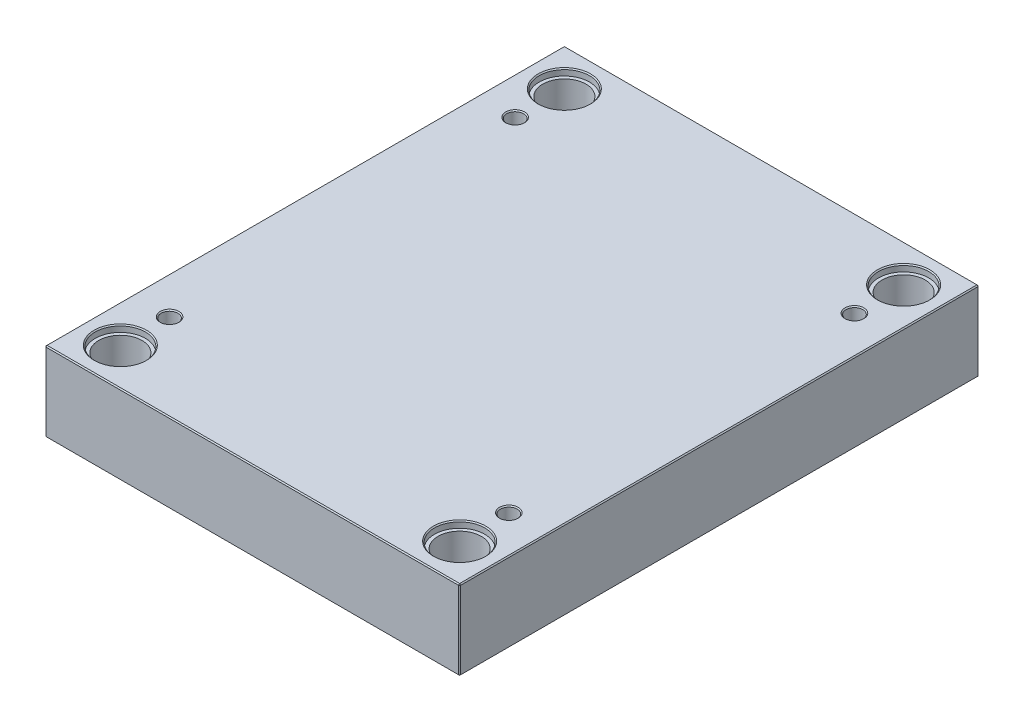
ISO-10303-21;
HEADER;
FILE_DESCRIPTION(('STEP AP214'),'2;1');
FILE_NAME('part.step','',(''),(''),'','','');
FILE_SCHEMA(('AUTOMOTIVE_DESIGN { 1 0 10303 214 1 1 1 1 }'));
ENDSEC;
DATA;
#1=APPLICATION_CONTEXT('core data for automotive mechanical design processes');
#2=APPLICATION_PROTOCOL_DEFINITION('international standard','automotive_design',2000,#1);
#3=PRODUCT_CONTEXT('',#1,'mechanical');
#4=PRODUCT('Part','Part','',(#3));
#5=PRODUCT_RELATED_PRODUCT_CATEGORY('part','',(#4));
#6=PRODUCT_DEFINITION_FORMATION('','',#4);
#7=PRODUCT_DEFINITION_CONTEXT('part definition',#1,'design');
#8=PRODUCT_DEFINITION('design','',#6,#7);
#9=PRODUCT_DEFINITION_SHAPE('','',#8);
#10=(LENGTH_UNIT() NAMED_UNIT(*) SI_UNIT(.MILLI.,.METRE.));
#11=(NAMED_UNIT(*) PLANE_ANGLE_UNIT() SI_UNIT($,.RADIAN.));
#12=(NAMED_UNIT(*) SI_UNIT($,.STERADIAN.) SOLID_ANGLE_UNIT());
#13=UNCERTAINTY_MEASURE_WITH_UNIT(LENGTH_MEASURE(1.E-05),#10,'distance_accuracy_value','');
#14=(GEOMETRIC_REPRESENTATION_CONTEXT(3) GLOBAL_UNCERTAINTY_ASSIGNED_CONTEXT((#13)) GLOBAL_UNIT_ASSIGNED_CONTEXT((#10,
#11,#12)) REPRESENTATION_CONTEXT('',''));
#15=CARTESIAN_POINT('',(0.,0.,0.));
#16=DIRECTION('',(0.,0.,1.));
#17=DIRECTION('',(1.,0.,0.));
#18=AXIS2_PLACEMENT_3D('',#15,#16,#17);
#19=CARTESIAN_POINT('',(-162.,0.,-212.));
#20=DIRECTION('',(0.,1.,0.));
#21=DIRECTION('',(0.,0.,1.));
#22=AXIS2_PLACEMENT_3D('',#19,#20,#21);
#23=CYLINDRICAL_SURFACE('',#22,20.65);
#24=CARTESIAN_POINT('',(-162.,0.999999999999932,-212.));
#25=DIRECTION('',(0.,1.,0.));
#26=DIRECTION('',(0.,0.,1.));
#27=AXIS2_PLACEMENT_3D('',#24,#25,#26);
#28=CIRCLE('',#27,20.65);
#29=CARTESIAN_POINT('',(-162.,0.999999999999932,-191.35));
#30=VERTEX_POINT('',#29);
#31=EDGE_CURVE('E472',#30,#30,#28,.F.);
#32=ORIENTED_EDGE('',*,*,#31,.T.);
#33=EDGE_LOOP('',(#32));
#34=FACE_BOUND('',#33,.T.);
#35=CARTESIAN_POINT('',(-162.,69.7,-212.));
#36=DIRECTION('',(0.,1.,0.));
#37=DIRECTION('',(0.,0.,1.));
#38=AXIS2_PLACEMENT_3D('',#35,#36,#37);
#39=CIRCLE('',#38,20.65);
#40=CARTESIAN_POINT('',(-162.,69.7,-191.35));
#41=VERTEX_POINT('',#40);
#42=EDGE_CURVE('E221',#41,#41,#39,.F.);
#43=ORIENTED_EDGE('',*,*,#42,.F.);
#44=EDGE_LOOP('',(#43));
#45=FACE_BOUND('',#44,.T.);
#46=ADVANCED_FACE('F16',(#34,#45),#23,.F.);
#47=CARTESIAN_POINT('',(162.,0.,-212.));
#48=DIRECTION('',(0.,1.,0.));
#49=DIRECTION('',(0.,0.,1.));
#50=AXIS2_PLACEMENT_3D('',#47,#48,#49);
#51=CYLINDRICAL_SURFACE('',#50,20.65);
#52=CARTESIAN_POINT('',(162.,0.999999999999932,-212.));
#53=DIRECTION('',(0.,1.,0.));
#54=DIRECTION('',(0.,0.,1.));
#55=AXIS2_PLACEMENT_3D('',#52,#53,#54);
#56=CIRCLE('',#55,20.65);
#57=CARTESIAN_POINT('',(162.,0.999999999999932,-191.35));
#58=VERTEX_POINT('',#57);
#59=EDGE_CURVE('E474',#58,#58,#56,.F.);
#60=ORIENTED_EDGE('',*,*,#59,.T.);
#61=EDGE_LOOP('',(#60));
#62=FACE_BOUND('',#61,.T.);
#63=CARTESIAN_POINT('',(162.,69.7,-212.));
#64=DIRECTION('',(0.,1.,0.));
#65=DIRECTION('',(0.,0.,1.));
#66=AXIS2_PLACEMENT_3D('',#63,#64,#65);
#67=CIRCLE('',#66,20.65);
#68=CARTESIAN_POINT('',(162.,69.7,-191.35));
#69=VERTEX_POINT('',#68);
#70=EDGE_CURVE('E218',#69,#69,#67,.F.);
#71=ORIENTED_EDGE('',*,*,#70,.F.);
#72=EDGE_LOOP('',(#71));
#73=FACE_BOUND('',#72,.T.);
#74=ADVANCED_FACE('F263',(#62,#73),#51,.F.);
#75=CARTESIAN_POINT('',(162.,0.,212.));
#76=DIRECTION('',(0.,1.,0.));
#77=DIRECTION('',(0.,0.,1.));
#78=AXIS2_PLACEMENT_3D('',#75,#76,#77);
#79=CYLINDRICAL_SURFACE('',#78,20.65);
#80=CARTESIAN_POINT('',(162.,1.00000000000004,212.));
#81=DIRECTION('',(0.,1.,0.));
#82=DIRECTION('',(0.,0.,1.));
#83=AXIS2_PLACEMENT_3D('',#80,#81,#82);
#84=CIRCLE('',#83,20.65);
#85=CARTESIAN_POINT('',(162.,1.00000000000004,232.65));
#86=VERTEX_POINT('',#85);
#87=EDGE_CURVE('E477',#86,#86,#84,.F.);
#88=ORIENTED_EDGE('',*,*,#87,.T.);
#89=EDGE_LOOP('',(#88));
#90=FACE_BOUND('',#89,.T.);
#91=CARTESIAN_POINT('',(162.,69.7,212.));
#92=DIRECTION('',(0.,1.,0.));
#93=DIRECTION('',(0.,0.,1.));
#94=AXIS2_PLACEMENT_3D('',#91,#92,#93);
#95=CIRCLE('',#94,20.65);
#96=CARTESIAN_POINT('',(162.,69.7,232.65));
#97=VERTEX_POINT('',#96);
#98=EDGE_CURVE('E214',#97,#97,#95,.F.);
#99=ORIENTED_EDGE('',*,*,#98,.F.);
#100=EDGE_LOOP('',(#99));
#101=FACE_BOUND('',#100,.T.);
#102=ADVANCED_FACE('F270',(#90,#101),#79,.F.);
#103=CARTESIAN_POINT('',(-162.,0.,212.));
#104=DIRECTION('',(0.,1.,0.));
#105=DIRECTION('',(0.,0.,1.));
#106=AXIS2_PLACEMENT_3D('',#103,#104,#105);
#107=CYLINDRICAL_SURFACE('',#106,20.65);
#108=CARTESIAN_POINT('',(-162.,0.999999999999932,212.));
#109=DIRECTION('',(0.,1.,0.));
#110=DIRECTION('',(0.,0.,1.));
#111=AXIS2_PLACEMENT_3D('',#108,#109,#110);
#112=CIRCLE('',#111,20.65);
#113=CARTESIAN_POINT('',(-162.,0.999999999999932,232.65));
#114=VERTEX_POINT('',#113);
#115=EDGE_CURVE('E480',#114,#114,#112,.F.);
#116=ORIENTED_EDGE('',*,*,#115,.T.);
#117=EDGE_LOOP('',(#116));
#118=FACE_BOUND('',#117,.T.);
#119=CARTESIAN_POINT('',(-162.,69.7,212.));
#120=DIRECTION('',(0.,1.,0.));
#121=DIRECTION('',(0.,0.,1.));
#122=AXIS2_PLACEMENT_3D('',#119,#120,#121);
#123=CIRCLE('',#122,20.65);
#124=CARTESIAN_POINT('',(-162.,69.7,232.65));
#125=VERTEX_POINT('',#124);
#126=EDGE_CURVE('E211',#125,#125,#123,.F.);
#127=ORIENTED_EDGE('',*,*,#126,.F.);
#128=EDGE_LOOP('',(#127));
#129=FACE_BOUND('',#128,.T.);
#130=ADVANCED_FACE('F277',(#118,#129),#107,.F.);
#131=CARTESIAN_POINT('',(-198.,76.,248.));
#132=DIRECTION('',(1.,0.,0.));
#133=DIRECTION('',(0.,0.,-1.));
#134=AXIS2_PLACEMENT_3D('',#131,#132,#133);
#135=PLANE('',#134);
#136=DIRECTION('',(0.,-1.,0.));
#137=VECTOR('',#136,1.);
#138=CARTESIAN_POINT('',(-198.,76.,-247.));
#139=LINE('',#138,#137);
#140=CARTESIAN_POINT('',(-198.,75.,-247.));
#141=VERTEX_POINT('',#140);
#142=CARTESIAN_POINT('',(-198.,1.00000000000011,-247.));
#143=VERTEX_POINT('',#142);
#144=EDGE_CURVE('E487',#141,#143,#139,.T.);
#145=ORIENTED_EDGE('',*,*,#144,.T.);
#146=DIRECTION('',(0.,0.,1.));
#147=VECTOR('',#146,1.);
#148=CARTESIAN_POINT('',(-198.,1.00000000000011,248.));
#149=LINE('',#148,#147);
#150=CARTESIAN_POINT('',(-198.,1.00000000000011,247.));
#151=VERTEX_POINT('',#150);
#152=EDGE_CURVE('E490',#143,#151,#149,.T.);
#153=ORIENTED_EDGE('',*,*,#152,.T.);
#154=DIRECTION('',(0.,1.,0.));
#155=VECTOR('',#154,1.);
#156=CARTESIAN_POINT('',(-198.,76.,247.));
#157=LINE('',#156,#155);
#158=CARTESIAN_POINT('',(-198.,75.,247.));
#159=VERTEX_POINT('',#158);
#160=EDGE_CURVE('E485',#151,#159,#157,.T.);
#161=ORIENTED_EDGE('',*,*,#160,.T.);
#162=DIRECTION('',(0.,0.,-1.));
#163=VECTOR('',#162,1.);
#164=CARTESIAN_POINT('',(-198.,75.,-248.));
#165=LINE('',#164,#163);
#166=EDGE_CURVE('E483',#159,#141,#165,.T.);
#167=ORIENTED_EDGE('',*,*,#166,.T.);
#168=EDGE_LOOP('',(#145,#153,#161,#167));
#169=FACE_BOUND('',#168,.T.);
#170=ADVANCED_FACE('F298',(#169),#135,.F.);
#171=CARTESIAN_POINT('',(198.,76.,248.));
#172=DIRECTION('',(0.,0.,-1.));
#173=DIRECTION('',(-1.,0.,0.));
#174=AXIS2_PLACEMENT_3D('',#171,#172,#173);
#175=PLANE('',#174);
#176=DIRECTION('',(-1.,0.,0.));
#177=VECTOR('',#176,1.);
#178=CARTESIAN_POINT('',(-198.,75.,248.));
#179=LINE('',#178,#177);
#180=CARTESIAN_POINT('',(197.,75.,248.));
#181=VERTEX_POINT('',#180);
#182=CARTESIAN_POINT('',(-197.,75.,248.));
#183=VERTEX_POINT('',#182);
#184=EDGE_CURVE('E509',#181,#183,#179,.T.);
#185=ORIENTED_EDGE('',*,*,#184,.T.);
#186=DIRECTION('',(0.,-1.,0.));
#187=VECTOR('',#186,1.);
#188=CARTESIAN_POINT('',(-197.,76.,248.));
#189=LINE('',#188,#187);
#190=CARTESIAN_POINT('',(-197.,1.00000000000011,248.));
#191=VERTEX_POINT('',#190);
#192=EDGE_CURVE('E515',#183,#191,#189,.T.);
#193=ORIENTED_EDGE('',*,*,#192,.T.);
#194=DIRECTION('',(1.,0.,0.));
#195=VECTOR('',#194,1.);
#196=CARTESIAN_POINT('',(198.,1.00000000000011,248.));
#197=LINE('',#196,#195);
#198=CARTESIAN_POINT('',(197.,1.00000000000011,248.));
#199=VERTEX_POINT('',#198);
#200=EDGE_CURVE('E513',#191,#199,#197,.T.);
#201=ORIENTED_EDGE('',*,*,#200,.T.);
#202=DIRECTION('',(0.,1.,0.));
#203=VECTOR('',#202,1.);
#204=CARTESIAN_POINT('',(197.,76.,248.));
#205=LINE('',#204,#203);
#206=EDGE_CURVE('E511',#199,#181,#205,.T.);
#207=ORIENTED_EDGE('',*,*,#206,.T.);
#208=EDGE_LOOP('',(#185,#193,#201,#207));
#209=FACE_BOUND('',#208,.T.);
#210=ADVANCED_FACE('F294',(#209),#175,.F.);
#211=CARTESIAN_POINT('',(198.,76.,248.));
#212=DIRECTION('',(-1.,0.,0.));
#213=DIRECTION('',(0.,0.,1.));
#214=AXIS2_PLACEMENT_3D('',#211,#212,#213);
#215=PLANE('',#214);
#216=DIRECTION('',(0.,0.,-1.));
#217=VECTOR('',#216,1.);
#218=CARTESIAN_POINT('',(198.,1.00000000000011,248.));
#219=LINE('',#218,#217);
#220=CARTESIAN_POINT('',(198.,1.00000000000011,247.));
#221=VERTEX_POINT('',#220);
#222=CARTESIAN_POINT('',(198.,1.00000000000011,-247.));
#223=VERTEX_POINT('',#222);
#224=EDGE_CURVE('E504',#221,#223,#219,.T.);
#225=ORIENTED_EDGE('',*,*,#224,.T.);
#226=DIRECTION('',(0.,1.,0.));
#227=VECTOR('',#226,1.);
#228=CARTESIAN_POINT('',(198.,76.,-247.));
#229=LINE('',#228,#227);
#230=CARTESIAN_POINT('',(198.,75.,-247.));
#231=VERTEX_POINT('',#230);
#232=EDGE_CURVE('E506',#223,#231,#229,.T.);
#233=ORIENTED_EDGE('',*,*,#232,.T.);
#234=DIRECTION('',(0.,0.,1.));
#235=VECTOR('',#234,1.);
#236=CARTESIAN_POINT('',(198.,75.,248.));
#237=LINE('',#236,#235);
#238=CARTESIAN_POINT('',(198.,75.,247.));
#239=VERTEX_POINT('',#238);
#240=EDGE_CURVE('E500',#231,#239,#237,.T.);
#241=ORIENTED_EDGE('',*,*,#240,.T.);
#242=DIRECTION('',(0.,-1.,0.));
#243=VECTOR('',#242,1.);
#244=CARTESIAN_POINT('',(198.,76.,247.));
#245=LINE('',#244,#243);
#246=EDGE_CURVE('E502',#239,#221,#245,.T.);
#247=ORIENTED_EDGE('',*,*,#246,.T.);
#248=EDGE_LOOP('',(#225,#233,#241,#247));
#249=FACE_BOUND('',#248,.T.);
#250=ADVANCED_FACE('F290',(#249),#215,.F.);
#251=CARTESIAN_POINT('',(198.,76.,-248.));
#252=DIRECTION('',(0.,0.,1.));
#253=DIRECTION('',(1.,0.,0.));
#254=AXIS2_PLACEMENT_3D('',#251,#252,#253);
#255=PLANE('',#254);
#256=DIRECTION('',(0.,-1.,0.));
#257=VECTOR('',#256,1.);
#258=CARTESIAN_POINT('',(197.,76.,-248.));
#259=LINE('',#258,#257);
#260=CARTESIAN_POINT('',(197.,75.,-248.));
#261=VERTEX_POINT('',#260);
#262=CARTESIAN_POINT('',(197.,1.00000000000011,-248.));
#263=VERTEX_POINT('',#262);
#264=EDGE_CURVE('E494',#261,#263,#259,.T.);
#265=ORIENTED_EDGE('',*,*,#264,.T.);
#266=DIRECTION('',(-1.,0.,0.));
#267=VECTOR('',#266,1.);
#268=CARTESIAN_POINT('',(198.,1.00000000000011,-248.));
#269=LINE('',#268,#267);
#270=CARTESIAN_POINT('',(-197.,1.00000000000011,-248.));
#271=VERTEX_POINT('',#270);
#272=EDGE_CURVE('E138',#263,#271,#269,.T.);
#273=ORIENTED_EDGE('',*,*,#272,.T.);
#274=DIRECTION('',(0.,1.,0.));
#275=VECTOR('',#274,1.);
#276=CARTESIAN_POINT('',(-197.,76.,-248.));
#277=LINE('',#276,#275);
#278=CARTESIAN_POINT('',(-197.,75.,-248.));
#279=VERTEX_POINT('',#278);
#280=EDGE_CURVE('E496',#271,#279,#277,.T.);
#281=ORIENTED_EDGE('',*,*,#280,.T.);
#282=DIRECTION('',(1.,0.,0.));
#283=VECTOR('',#282,1.);
#284=CARTESIAN_POINT('',(198.,75.,-248.));
#285=LINE('',#284,#283);
#286=EDGE_CURVE('E492',#279,#261,#285,.T.);
#287=ORIENTED_EDGE('',*,*,#286,.T.);
#288=EDGE_LOOP('',(#265,#273,#281,#287));
#289=FACE_BOUND('',#288,.T.);
#290=ADVANCED_FACE('F282',(#289),#255,.F.);
#291=CARTESIAN_POINT('',(0.,76.,0.));
#292=DIRECTION('',(0.,1.,0.));
#293=DIRECTION('',(0.,0.,1.));
#294=AXIS2_PLACEMENT_3D('',#291,#292,#293);
#295=PLANE('',#294);
#296=CARTESIAN_POINT('',(162.,76.,212.));
#297=DIRECTION('',(0.,1.,0.));
#298=DIRECTION('',(0.,0.,1.));
#299=AXIS2_PLACEMENT_3D('',#296,#297,#298);
#300=CIRCLE('',#299,25.);
#301=CARTESIAN_POINT('',(162.,76.,237.));
#302=VERTEX_POINT('',#301);
#303=EDGE_CURVE('E236',#302,#302,#300,.F.);
#304=ORIENTED_EDGE('',*,*,#303,.T.);
#305=EDGE_LOOP('',(#304));
#306=FACE_BOUND('',#305,.T.);
#307=CARTESIAN_POINT('',(-162.,76.,212.));
#308=DIRECTION('',(0.,1.,0.));
#309=DIRECTION('',(0.,0.,1.));
#310=AXIS2_PLACEMENT_3D('',#307,#308,#309);
#311=CIRCLE('',#310,25.);
#312=CARTESIAN_POINT('',(-162.,76.,237.));
#313=VERTEX_POINT('',#312);
#314=EDGE_CURVE('E233',#313,#313,#311,.F.);
#315=ORIENTED_EDGE('',*,*,#314,.T.);
#316=EDGE_LOOP('',(#315));
#317=FACE_BOUND('',#316,.T.);
#318=CARTESIAN_POINT('',(162.,76.,-212.));
#319=DIRECTION('',(0.,1.,0.));
#320=DIRECTION('',(0.,0.,1.));
#321=AXIS2_PLACEMENT_3D('',#318,#319,#320);
#322=CIRCLE('',#321,25.);
#323=CARTESIAN_POINT('',(162.,76.,-187.));
#324=VERTEX_POINT('',#323);
#325=EDGE_CURVE('E230',#324,#324,#322,.F.);
#326=ORIENTED_EDGE('',*,*,#325,.T.);
#327=EDGE_LOOP('',(#326));
#328=FACE_BOUND('',#327,.T.);
#329=CARTESIAN_POINT('',(-162.,76.,-212.));
#330=DIRECTION('',(0.,1.,0.));
#331=DIRECTION('',(0.,0.,1.));
#332=AXIS2_PLACEMENT_3D('',#329,#330,#331);
#333=CIRCLE('',#332,25.);
#334=CARTESIAN_POINT('',(-162.,76.,-187.));
#335=VERTEX_POINT('',#334);
#336=EDGE_CURVE('E227',#335,#335,#333,.F.);
#337=ORIENTED_EDGE('',*,*,#336,.T.);
#338=EDGE_LOOP('',(#337));
#339=FACE_BOUND('',#338,.T.);
#340=CARTESIAN_POINT('',(-162.,76.,165.));
#341=DIRECTION('',(0.,1.,0.));
#342=DIRECTION('',(0.,0.,1.));
#343=AXIS2_PLACEMENT_3D('',#340,#341,#342);
#344=CIRCLE('',#343,9.00000000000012);
#345=CARTESIAN_POINT('',(-162.,76.,174.));
#346=VERTEX_POINT('',#345);
#347=EDGE_CURVE('E198',#346,#346,#344,.F.);
#348=ORIENTED_EDGE('',*,*,#347,.T.);
#349=EDGE_LOOP('',(#348));
#350=FACE_BOUND('',#349,.T.);
#351=CARTESIAN_POINT('',(162.,76.,165.));
#352=DIRECTION('',(0.,1.,0.));
#353=DIRECTION('',(0.,0.,1.));
#354=AXIS2_PLACEMENT_3D('',#351,#352,#353);
#355=CIRCLE('',#354,9.);
#356=CARTESIAN_POINT('',(162.,76.,174.));
#357=VERTEX_POINT('',#356);
#358=EDGE_CURVE('E195',#357,#357,#355,.F.);
#359=ORIENTED_EDGE('',*,*,#358,.T.);
#360=EDGE_LOOP('',(#359));
#361=FACE_BOUND('',#360,.T.);
#362=CARTESIAN_POINT('',(162.,76.,-165.));
#363=DIRECTION('',(0.,1.,0.));
#364=DIRECTION('',(0.,0.,1.));
#365=AXIS2_PLACEMENT_3D('',#362,#363,#364);
#366=CIRCLE('',#365,9.00000000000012);
#367=CARTESIAN_POINT('',(162.,76.,-156.));
#368=VERTEX_POINT('',#367);
#369=EDGE_CURVE('E192',#368,#368,#366,.F.);
#370=ORIENTED_EDGE('',*,*,#369,.T.);
#371=EDGE_LOOP('',(#370));
#372=FACE_BOUND('',#371,.T.);
#373=CARTESIAN_POINT('',(-162.,76.,-165.));
#374=DIRECTION('',(0.,1.,0.));
#375=DIRECTION('',(0.,0.,1.));
#376=AXIS2_PLACEMENT_3D('',#373,#374,#375);
#377=CIRCLE('',#376,9.);
#378=CARTESIAN_POINT('',(-162.,76.,-156.));
#379=VERTEX_POINT('',#378);
#380=EDGE_CURVE('E188',#379,#379,#377,.F.);
#381=ORIENTED_EDGE('',*,*,#380,.T.);
#382=EDGE_LOOP('',(#381));
#383=FACE_BOUND('',#382,.T.);
#384=DIRECTION('',(0.,0.,-1.));
#385=VECTOR('',#384,1.);
#386=CARTESIAN_POINT('',(197.,76.,-248.));
#387=LINE('',#386,#385);
#388=CARTESIAN_POINT('',(197.,76.,247.));
#389=VERTEX_POINT('',#388);
#390=CARTESIAN_POINT('',(197.,76.,-247.));
#391=VERTEX_POINT('',#390);
#392=EDGE_CURVE('E31',#389,#391,#387,.T.);
#393=ORIENTED_EDGE('',*,*,#392,.T.);
#394=DIRECTION('',(-1.,0.,0.));
#395=VECTOR('',#394,1.);
#396=CARTESIAN_POINT('',(-198.,76.,-247.));
#397=LINE('',#396,#395);
#398=CARTESIAN_POINT('',(-197.,76.,-247.));
#399=VERTEX_POINT('',#398);
#400=EDGE_CURVE('E189',#391,#399,#397,.T.);
#401=ORIENTED_EDGE('',*,*,#400,.T.);
#402=DIRECTION('',(0.,0.,1.));
#403=VECTOR('',#402,1.);
#404=CARTESIAN_POINT('',(-197.,76.,248.));
#405=LINE('',#404,#403);
#406=CARTESIAN_POINT('',(-197.,76.,247.));
#407=VERTEX_POINT('',#406);
#408=EDGE_CURVE('E518',#399,#407,#405,.T.);
#409=ORIENTED_EDGE('',*,*,#408,.T.);
#410=DIRECTION('',(1.,0.,0.));
#411=VECTOR('',#410,1.);
#412=CARTESIAN_POINT('',(198.,76.,247.));
#413=LINE('',#412,#411);
#414=EDGE_CURVE('E36',#407,#389,#413,.T.);
#415=ORIENTED_EDGE('',*,*,#414,.T.);
#416=EDGE_LOOP('',(#393,#401,#409,#415));
#417=FACE_BOUND('',#416,.T.);
#418=ADVANCED_FACE('F279',(#306,#317,#328,#339,#350,#361,#372,#383,#417),#295,.T.);
#419=CARTESIAN_POINT('',(0.,0.,0.));
#420=DIRECTION('',(0.,1.,0.));
#421=DIRECTION('',(0.,0.,1.));
#422=AXIS2_PLACEMENT_3D('',#419,#420,#421);
#423=PLANE('',#422);
#424=CARTESIAN_POINT('',(-162.,0.,-212.));
#425=DIRECTION('',(0.,1.,0.));
#426=DIRECTION('',(0.,0.,1.));
#427=AXIS2_PLACEMENT_3D('',#424,#425,#426);
#428=CIRCLE('',#427,21.65);
#429=CARTESIAN_POINT('',(-162.,0.,-190.35));
#430=VERTEX_POINT('',#429);
#431=EDGE_CURVE('E469',#430,#430,#428,.T.);
#432=ORIENTED_EDGE('',*,*,#431,.T.);
#433=EDGE_LOOP('',(#432));
#434=FACE_BOUND('',#433,.T.);
#435=CARTESIAN_POINT('',(162.,0.,-212.));
#436=DIRECTION('',(0.,1.,0.));
#437=DIRECTION('',(0.,0.,1.));
#438=AXIS2_PLACEMENT_3D('',#435,#436,#437);
#439=CIRCLE('',#438,21.65);
#440=CARTESIAN_POINT('',(162.,0.,-190.35));
#441=VERTEX_POINT('',#440);
#442=EDGE_CURVE('E466',#441,#441,#439,.T.);
#443=ORIENTED_EDGE('',*,*,#442,.T.);
#444=EDGE_LOOP('',(#443));
#445=FACE_BOUND('',#444,.T.);
#446=CARTESIAN_POINT('',(162.,0.,212.));
#447=DIRECTION('',(0.,1.,0.));
#448=DIRECTION('',(0.,0.,1.));
#449=AXIS2_PLACEMENT_3D('',#446,#447,#448);
#450=CIRCLE('',#449,21.65);
#451=CARTESIAN_POINT('',(162.,0.,233.65));
#452=VERTEX_POINT('',#451);
#453=EDGE_CURVE('E463',#452,#452,#450,.T.);
#454=ORIENTED_EDGE('',*,*,#453,.T.);
#455=EDGE_LOOP('',(#454));
#456=FACE_BOUND('',#455,.T.);
#457=CARTESIAN_POINT('',(-162.,0.,212.));
#458=DIRECTION('',(0.,1.,0.));
#459=DIRECTION('',(0.,0.,1.));
#460=AXIS2_PLACEMENT_3D('',#457,#458,#459);
#461=CIRCLE('',#460,21.65);
#462=CARTESIAN_POINT('',(-162.,0.,233.65));
#463=VERTEX_POINT('',#462);
#464=EDGE_CURVE('E460',#463,#463,#461,.T.);
#465=ORIENTED_EDGE('',*,*,#464,.T.);
#466=EDGE_LOOP('',(#465));
#467=FACE_BOUND('',#466,.T.);
#468=DIRECTION('',(0.,0.,1.));
#469=VECTOR('',#468,1.);
#470=CARTESIAN_POINT('',(197.,0.,0.));
#471=LINE('',#470,#469);
#472=CARTESIAN_POINT('',(197.,0.,-247.));
#473=VERTEX_POINT('',#472);
#474=CARTESIAN_POINT('',(197.,0.,247.));
#475=VERTEX_POINT('',#474);
#476=EDGE_CURVE('E108',#473,#475,#471,.T.);
#477=ORIENTED_EDGE('',*,*,#476,.T.);
#478=DIRECTION('',(-1.,0.,0.));
#479=VECTOR('',#478,1.);
#480=CARTESIAN_POINT('',(0.,0.,247.));
#481=LINE('',#480,#479);
#482=CARTESIAN_POINT('',(-197.,0.,247.));
#483=VERTEX_POINT('',#482);
#484=EDGE_CURVE('E458',#475,#483,#481,.T.);
#485=ORIENTED_EDGE('',*,*,#484,.T.);
#486=DIRECTION('',(0.,0.,-1.));
#487=VECTOR('',#486,1.);
#488=CARTESIAN_POINT('',(-197.,0.,0.));
#489=LINE('',#488,#487);
#490=CARTESIAN_POINT('',(-197.,0.,-247.));
#491=VERTEX_POINT('',#490);
#492=EDGE_CURVE('E110',#483,#491,#489,.T.);
#493=ORIENTED_EDGE('',*,*,#492,.T.);
#494=DIRECTION('',(1.,0.,0.));
#495=VECTOR('',#494,1.);
#496=CARTESIAN_POINT('',(0.,0.,-247.));
#497=LINE('',#496,#495);
#498=EDGE_CURVE('E104',#491,#473,#497,.T.);
#499=ORIENTED_EDGE('',*,*,#498,.T.);
#500=EDGE_LOOP('',(#477,#485,#493,#499));
#501=FACE_BOUND('',#500,.T.);
#502=ADVANCED_FACE('F106',(#434,#445,#456,#467,#501),#423,.F.);
#503=CARTESIAN_POINT('',(-162.,0.,-212.));
#504=DIRECTION('',(0.,-1.,0.));
#505=DIRECTION('',(0.,0.,-1.));
#506=AXIS2_PLACEMENT_3D('',#503,#504,#505);
#507=CONICAL_SURFACE('',#506,21.65,0.785398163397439);
#508=ORIENTED_EDGE('',*,*,#31,.F.);
#509=EDGE_LOOP('',(#508));
#510=FACE_BOUND('',#509,.T.);
#511=ORIENTED_EDGE('',*,*,#431,.F.);
#512=EDGE_LOOP('',(#511));
#513=FACE_BOUND('',#512,.T.);
#514=ADVANCED_FACE('F286',(#510,#513),#507,.F.);
#515=CARTESIAN_POINT('',(162.,0.,-212.));
#516=DIRECTION('',(0.,-1.,0.));
#517=DIRECTION('',(0.,0.,-1.));
#518=AXIS2_PLACEMENT_3D('',#515,#516,#517);
#519=CONICAL_SURFACE('',#518,21.65,0.785398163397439);
#520=ORIENTED_EDGE('',*,*,#59,.F.);
#521=EDGE_LOOP('',(#520));
#522=FACE_BOUND('',#521,.T.);
#523=ORIENTED_EDGE('',*,*,#442,.F.);
#524=EDGE_LOOP('',(#523));
#525=FACE_BOUND('',#524,.T.);
#526=ADVANCED_FACE('F305',(#522,#525),#519,.F.);
#527=CARTESIAN_POINT('',(162.,0.,212.));
#528=DIRECTION('',(0.,-1.,0.));
#529=DIRECTION('',(0.,0.,-1.));
#530=AXIS2_PLACEMENT_3D('',#527,#528,#529);
#531=CONICAL_SURFACE('',#530,21.65,0.785398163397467);
#532=ORIENTED_EDGE('',*,*,#87,.F.);
#533=EDGE_LOOP('',(#532));
#534=FACE_BOUND('',#533,.T.);
#535=ORIENTED_EDGE('',*,*,#453,.F.);
#536=EDGE_LOOP('',(#535));
#537=FACE_BOUND('',#536,.T.);
#538=ADVANCED_FACE('F309',(#534,#537),#531,.F.);
#539=CARTESIAN_POINT('',(-162.,0.,212.));
#540=DIRECTION('',(0.,-1.,0.));
#541=DIRECTION('',(0.,0.,-1.));
#542=AXIS2_PLACEMENT_3D('',#539,#540,#541);
#543=CONICAL_SURFACE('',#542,21.65,0.785398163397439);
#544=ORIENTED_EDGE('',*,*,#115,.F.);
#545=EDGE_LOOP('',(#544));
#546=FACE_BOUND('',#545,.T.);
#547=ORIENTED_EDGE('',*,*,#464,.F.);
#548=EDGE_LOOP('',(#547));
#549=FACE_BOUND('',#548,.T.);
#550=ADVANCED_FACE('F313',(#546,#549),#543,.F.);
#551=CARTESIAN_POINT('',(198.,76.,247.));
#552=DIRECTION('',(-0.707106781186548,0.,-0.707106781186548));
#553=DIRECTION('',(0.,-1.,0.));
#554=AXIS2_PLACEMENT_3D('',#551,#552,#553);
#555=PLANE('',#554);
#556=DIRECTION('',(-0.707106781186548,0.,0.707106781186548));
#557=VECTOR('',#556,1.);
#558=CARTESIAN_POINT('',(197.,75.,248.));
#559=LINE('',#558,#557);
#560=EDGE_CURVE('E126',#181,#239,#559,.F.);
#561=ORIENTED_EDGE('',*,*,#560,.F.);
#562=ORIENTED_EDGE('',*,*,#206,.F.);
#563=DIRECTION('',(0.707106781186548,0.,-0.707106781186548));
#564=VECTOR('',#563,1.);
#565=CARTESIAN_POINT('',(197.,1.00000000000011,248.));
#566=LINE('',#565,#564);
#567=EDGE_CURVE('E180',#221,#199,#566,.F.);
#568=ORIENTED_EDGE('',*,*,#567,.F.);
#569=ORIENTED_EDGE('',*,*,#246,.F.);
#570=EDGE_LOOP('',(#561,#562,#568,#569));
#571=FACE_BOUND('',#570,.T.);
#572=ADVANCED_FACE('F317',(#571),#555,.F.);
#573=CARTESIAN_POINT('',(197.,75.,248.));
#574=DIRECTION('',(0.577350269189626,0.577350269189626,0.577350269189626));
#575=DIRECTION('',(0.707106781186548,0.,-0.707106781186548));
#576=AXIS2_PLACEMENT_3D('',#573,#574,#575);
#577=PLANE('',#576);
#578=DIRECTION('',(0.,-0.707106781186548,0.707106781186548));
#579=VECTOR('',#578,1.);
#580=CARTESIAN_POINT('',(197.,75.,248.));
#581=LINE('',#580,#579);
#582=EDGE_CURVE('E175',#181,#389,#581,.F.);
#583=ORIENTED_EDGE('',*,*,#582,.F.);
#584=ORIENTED_EDGE('',*,*,#560,.T.);
#585=DIRECTION('',(-0.707106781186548,0.707106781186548,0.));
#586=VECTOR('',#585,1.);
#587=CARTESIAN_POINT('',(197.5,75.5,247.));
#588=LINE('',#587,#586);
#589=EDGE_CURVE('E177',#389,#239,#588,.F.);
#590=ORIENTED_EDGE('',*,*,#589,.F.);
#591=EDGE_LOOP('',(#583,#584,#590));
#592=FACE_BOUND('',#591,.T.);
#593=ADVANCED_FACE('F385',(#592),#577,.T.);
#594=CARTESIAN_POINT('',(197.,1.00000000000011,248.));
#595=DIRECTION('',(0.577350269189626,-0.577350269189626,0.577350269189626));
#596=DIRECTION('',(0.707106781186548,0.,-0.707106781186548));
#597=AXIS2_PLACEMENT_3D('',#594,#595,#596);
#598=PLANE('',#597);
#599=DIRECTION('',(-0.707106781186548,-0.707106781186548,0.));
#600=VECTOR('',#599,1.);
#601=CARTESIAN_POINT('',(197.5,0.500000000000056,247.));
#602=LINE('',#601,#600);
#603=EDGE_CURVE('E124',#221,#475,#602,.T.);
#604=ORIENTED_EDGE('',*,*,#603,.F.);
#605=ORIENTED_EDGE('',*,*,#567,.T.);
#606=DIRECTION('',(0.,0.707106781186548,0.707106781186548));
#607=VECTOR('',#606,1.);
#608=CARTESIAN_POINT('',(197.,1.00000000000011,248.));
#609=LINE('',#608,#607);
#610=EDGE_CURVE('E172',#475,#199,#609,.T.);
#611=ORIENTED_EDGE('',*,*,#610,.F.);
#612=EDGE_LOOP('',(#604,#605,#611));
#613=FACE_BOUND('',#612,.T.);
#614=ADVANCED_FACE('F381',(#613),#598,.T.);
#615=CARTESIAN_POINT('',(197.,76.,0.));
#616=DIRECTION('',(0.707106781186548,0.707106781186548,0.));
#617=DIRECTION('',(0.,0.,1.));
#618=AXIS2_PLACEMENT_3D('',#615,#616,#617);
#619=PLANE('',#618);
#620=ORIENTED_EDGE('',*,*,#589,.T.);
#621=ORIENTED_EDGE('',*,*,#240,.F.);
#622=DIRECTION('',(0.707106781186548,-0.707106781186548,0.));
#623=VECTOR('',#622,1.);
#624=CARTESIAN_POINT('',(198.,75.,-247.));
#625=LINE('',#624,#623);
#626=EDGE_CURVE('E166',#391,#231,#625,.T.);
#627=ORIENTED_EDGE('',*,*,#626,.F.);
#628=ORIENTED_EDGE('',*,*,#392,.F.);
#629=EDGE_LOOP('',(#620,#621,#627,#628));
#630=FACE_BOUND('',#629,.T.);
#631=ADVANCED_FACE('F377',(#630),#619,.T.);
#632=CARTESIAN_POINT('',(0.,76.,247.));
#633=DIRECTION('',(0.,0.707106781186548,0.707106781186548));
#634=DIRECTION('',(-1.,0.,0.));
#635=AXIS2_PLACEMENT_3D('',#632,#633,#634);
#636=PLANE('',#635);
#637=ORIENTED_EDGE('',*,*,#582,.T.);
#638=ORIENTED_EDGE('',*,*,#414,.F.);
#639=DIRECTION('',(0.,0.707106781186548,-0.707106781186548));
#640=VECTOR('',#639,1.);
#641=CARTESIAN_POINT('',(-197.,75.5,247.5));
#642=LINE('',#641,#640);
#643=EDGE_CURVE('E163',#183,#407,#642,.T.);
#644=ORIENTED_EDGE('',*,*,#643,.F.);
#645=ORIENTED_EDGE('',*,*,#184,.F.);
#646=EDGE_LOOP('',(#637,#638,#644,#645));
#647=FACE_BOUND('',#646,.T.);
#648=ADVANCED_FACE('F373',(#647),#636,.T.);
#649=CARTESIAN_POINT('',(-197.,76.,248.));
#650=DIRECTION('',(0.707106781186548,0.,-0.707106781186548));
#651=DIRECTION('',(0.,-1.,0.));
#652=AXIS2_PLACEMENT_3D('',#649,#650,#651);
#653=PLANE('',#652);
#654=DIRECTION('',(0.707106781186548,0.,0.707106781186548));
#655=VECTOR('',#654,1.);
#656=CARTESIAN_POINT('',(-197.,1.00000000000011,248.));
#657=LINE('',#656,#655);
#658=EDGE_CURVE('E157',#191,#151,#657,.F.);
#659=ORIENTED_EDGE('',*,*,#658,.F.);
#660=ORIENTED_EDGE('',*,*,#192,.F.);
#661=DIRECTION('',(-0.707106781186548,0.,-0.707106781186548));
#662=VECTOR('',#661,1.);
#663=CARTESIAN_POINT('',(-198.,75.,247.));
#664=LINE('',#663,#662);
#665=EDGE_CURVE('E160',#159,#183,#664,.F.);
#666=ORIENTED_EDGE('',*,*,#665,.F.);
#667=ORIENTED_EDGE('',*,*,#160,.F.);
#668=EDGE_LOOP('',(#659,#660,#666,#667));
#669=FACE_BOUND('',#668,.T.);
#670=ADVANCED_FACE('F369',(#669),#653,.F.);
#671=CARTESIAN_POINT('',(198.,1.00000000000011,248.));
#672=DIRECTION('',(0.,0.707106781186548,-0.707106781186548));
#673=DIRECTION('',(1.,0.,0.));
#674=AXIS2_PLACEMENT_3D('',#671,#672,#673);
#675=PLANE('',#674);
#676=ORIENTED_EDGE('',*,*,#610,.T.);
#677=ORIENTED_EDGE('',*,*,#200,.F.);
#678=DIRECTION('',(0.,-0.707106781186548,-0.707106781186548));
#679=VECTOR('',#678,1.);
#680=CARTESIAN_POINT('',(-197.,1.00000000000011,248.));
#681=LINE('',#680,#679);
#682=EDGE_CURVE('E135',#483,#191,#681,.F.);
#683=ORIENTED_EDGE('',*,*,#682,.F.);
#684=ORIENTED_EDGE('',*,*,#484,.F.);
#685=EDGE_LOOP('',(#676,#677,#683,#684));
#686=FACE_BOUND('',#685,.T.);
#687=ADVANCED_FACE('F366',(#686),#675,.F.);
#688=CARTESIAN_POINT('',(198.,1.00000000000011,248.));
#689=DIRECTION('',(-0.707106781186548,0.707106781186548,0.));
#690=DIRECTION('',(0.,0.,-1.));
#691=AXIS2_PLACEMENT_3D('',#688,#689,#690);
#692=PLANE('',#691);
#693=ORIENTED_EDGE('',*,*,#603,.T.);
#694=ORIENTED_EDGE('',*,*,#476,.F.);
#695=DIRECTION('',(0.707106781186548,0.707106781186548,0.));
#696=VECTOR('',#695,1.);
#697=CARTESIAN_POINT('',(197.5,0.50000000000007,-247.));
#698=LINE('',#697,#696);
#699=EDGE_CURVE('E121',#223,#473,#698,.F.);
#700=ORIENTED_EDGE('',*,*,#699,.F.);
#701=ORIENTED_EDGE('',*,*,#224,.F.);
#702=EDGE_LOOP('',(#693,#694,#700,#701));
#703=FACE_BOUND('',#702,.T.);
#704=ADVANCED_FACE('F119',(#703),#692,.F.);
#705=CARTESIAN_POINT('',(197.,76.,-248.));
#706=DIRECTION('',(-0.707106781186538,0.,0.707106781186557));
#707=DIRECTION('',(0.,-1.,0.));
#708=AXIS2_PLACEMENT_3D('',#705,#706,#707);
#709=PLANE('',#708);
#710=DIRECTION('',(0.707106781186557,0.,0.707106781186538));
#711=VECTOR('',#710,1.);
#712=CARTESIAN_POINT('',(198.,75.,-247.));
#713=LINE('',#712,#711);
#714=EDGE_CURVE('E168',#231,#261,#713,.F.);
#715=ORIENTED_EDGE('',*,*,#714,.F.);
#716=ORIENTED_EDGE('',*,*,#232,.F.);
#717=DIRECTION('',(-0.707106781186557,0.,-0.707106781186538));
#718=VECTOR('',#717,1.);
#719=CARTESIAN_POINT('',(197.,1.00000000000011,-248.));
#720=LINE('',#719,#718);
#721=EDGE_CURVE('E134',#263,#223,#720,.F.);
#722=ORIENTED_EDGE('',*,*,#721,.F.);
#723=ORIENTED_EDGE('',*,*,#264,.F.);
#724=EDGE_LOOP('',(#715,#716,#722,#723));
#725=FACE_BOUND('',#724,.T.);
#726=ADVANCED_FACE('F359',(#725),#709,.F.);
#727=CARTESIAN_POINT('',(198.,75.,-247.));
#728=DIRECTION('',(0.577350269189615,0.577350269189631,-0.577350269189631));
#729=DIRECTION('',(0.,0.707106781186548,0.707106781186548));
#730=AXIS2_PLACEMENT_3D('',#727,#728,#729);
#731=PLANE('',#730);
#732=ORIENTED_EDGE('',*,*,#626,.T.);
#733=ORIENTED_EDGE('',*,*,#714,.T.);
#734=DIRECTION('',(0.,0.707106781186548,0.707106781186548));
#735=VECTOR('',#734,1.);
#736=CARTESIAN_POINT('',(197.,75.5,-247.5));
#737=LINE('',#736,#735);
#738=EDGE_CURVE('E152',#391,#261,#737,.F.);
#739=ORIENTED_EDGE('',*,*,#738,.F.);
#740=EDGE_LOOP('',(#732,#733,#739));
#741=FACE_BOUND('',#740,.T.);
#742=ADVANCED_FACE('F355',(#741),#731,.T.);
#743=CARTESIAN_POINT('',(-198.,75.,247.));
#744=DIRECTION('',(-0.577350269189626,0.577350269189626,0.577350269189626));
#745=DIRECTION('',(0.707106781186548,0.,0.707106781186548));
#746=AXIS2_PLACEMENT_3D('',#743,#744,#745);
#747=PLANE('',#746);
#748=ORIENTED_EDGE('',*,*,#665,.T.);
#749=ORIENTED_EDGE('',*,*,#643,.T.);
#750=DIRECTION('',(-0.707106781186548,-0.707106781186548,0.));
#751=VECTOR('',#750,1.);
#752=CARTESIAN_POINT('',(-198.,75.,247.));
#753=LINE('',#752,#751);
#754=EDGE_CURVE('E143',#159,#407,#753,.F.);
#755=ORIENTED_EDGE('',*,*,#754,.F.);
#756=EDGE_LOOP('',(#748,#749,#755));
#757=FACE_BOUND('',#756,.T.);
#758=ADVANCED_FACE('F351',(#757),#747,.T.);
#759=CARTESIAN_POINT('',(-197.,1.00000000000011,248.));
#760=DIRECTION('',(-0.577350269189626,-0.577350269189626,0.577350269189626));
#761=DIRECTION('',(0.707106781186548,0.,0.707106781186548));
#762=AXIS2_PLACEMENT_3D('',#759,#760,#761);
#763=PLANE('',#762);
#764=ORIENTED_EDGE('',*,*,#682,.T.);
#765=ORIENTED_EDGE('',*,*,#658,.T.);
#766=DIRECTION('',(-0.707106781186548,0.707106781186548,0.));
#767=VECTOR('',#766,1.);
#768=CARTESIAN_POINT('',(-197.5,0.500000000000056,247.));
#769=LINE('',#768,#767);
#770=EDGE_CURVE('E139',#483,#151,#769,.T.);
#771=ORIENTED_EDGE('',*,*,#770,.F.);
#772=EDGE_LOOP('',(#764,#765,#771));
#773=FACE_BOUND('',#772,.T.);
#774=ADVANCED_FACE('F348',(#773),#763,.T.);
#775=CARTESIAN_POINT('',(197.,1.00000000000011,-248.));
#776=DIRECTION('',(0.577350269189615,-0.577350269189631,-0.577350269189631));
#777=DIRECTION('',(0.,0.707106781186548,-0.707106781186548));
#778=AXIS2_PLACEMENT_3D('',#775,#776,#777);
#779=PLANE('',#778);
#780=ORIENTED_EDGE('',*,*,#721,.T.);
#781=ORIENTED_EDGE('',*,*,#699,.T.);
#782=DIRECTION('',(0.,-0.707106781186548,0.707106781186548));
#783=VECTOR('',#782,1.);
#784=CARTESIAN_POINT('',(197.,1.00000000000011,-248.));
#785=LINE('',#784,#783);
#786=EDGE_CURVE('E131',#263,#473,#785,.T.);
#787=ORIENTED_EDGE('',*,*,#786,.F.);
#788=EDGE_LOOP('',(#780,#781,#787));
#789=FACE_BOUND('',#788,.T.);
#790=ADVANCED_FACE('F130',(#789),#779,.T.);
#791=CARTESIAN_POINT('',(0.,76.,-247.));
#792=DIRECTION('',(0.,0.707106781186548,-0.707106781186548));
#793=DIRECTION('',(1.,0.,0.));
#794=AXIS2_PLACEMENT_3D('',#791,#792,#793);
#795=PLANE('',#794);
#796=ORIENTED_EDGE('',*,*,#738,.T.);
#797=ORIENTED_EDGE('',*,*,#286,.F.);
#798=DIRECTION('',(0.,-0.707106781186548,-0.707106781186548));
#799=VECTOR('',#798,1.);
#800=CARTESIAN_POINT('',(-197.,75.,-248.));
#801=LINE('',#800,#799);
#802=EDGE_CURVE('E140',#399,#279,#801,.T.);
#803=ORIENTED_EDGE('',*,*,#802,.F.);
#804=ORIENTED_EDGE('',*,*,#400,.F.);
#805=EDGE_LOOP('',(#796,#797,#803,#804));
#806=FACE_BOUND('',#805,.T.);
#807=ADVANCED_FACE('F341',(#806),#795,.T.);
#808=CARTESIAN_POINT('',(-197.,76.,0.));
#809=DIRECTION('',(-0.707106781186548,0.707106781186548,0.));
#810=DIRECTION('',(0.,0.,-1.));
#811=AXIS2_PLACEMENT_3D('',#808,#809,#810);
#812=PLANE('',#811);
#813=ORIENTED_EDGE('',*,*,#754,.T.);
#814=ORIENTED_EDGE('',*,*,#408,.F.);
#815=DIRECTION('',(0.707106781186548,0.707106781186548,0.));
#816=VECTOR('',#815,1.);
#817=CARTESIAN_POINT('',(-197.5,75.5,-247.));
#818=LINE('',#817,#816);
#819=EDGE_CURVE('E146',#141,#399,#818,.T.);
#820=ORIENTED_EDGE('',*,*,#819,.F.);
#821=ORIENTED_EDGE('',*,*,#166,.F.);
#822=EDGE_LOOP('',(#813,#814,#820,#821));
#823=FACE_BOUND('',#822,.T.);
#824=ADVANCED_FACE('F337',(#823),#812,.T.);
#825=CARTESIAN_POINT('',(-198.,1.00000000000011,248.));
#826=DIRECTION('',(0.707106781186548,0.707106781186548,0.));
#827=DIRECTION('',(0.,0.,1.));
#828=AXIS2_PLACEMENT_3D('',#825,#826,#827);
#829=PLANE('',#828);
#830=ORIENTED_EDGE('',*,*,#770,.T.);
#831=ORIENTED_EDGE('',*,*,#152,.F.);
#832=DIRECTION('',(0.707106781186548,-0.707106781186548,0.));
#833=VECTOR('',#832,1.);
#834=CARTESIAN_POINT('',(-198.,1.00000000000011,-247.));
#835=LINE('',#834,#833);
#836=EDGE_CURVE('E529',#491,#143,#835,.F.);
#837=ORIENTED_EDGE('',*,*,#836,.F.);
#838=ORIENTED_EDGE('',*,*,#492,.F.);
#839=EDGE_LOOP('',(#830,#831,#837,#838));
#840=FACE_BOUND('',#839,.T.);
#841=ADVANCED_FACE('F334',(#840),#829,.F.);
#842=CARTESIAN_POINT('',(198.,1.00000000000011,-248.));
#843=DIRECTION('',(0.,0.707106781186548,0.707106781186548));
#844=DIRECTION('',(-1.,0.,0.));
#845=AXIS2_PLACEMENT_3D('',#842,#843,#844);
#846=PLANE('',#845);
#847=ORIENTED_EDGE('',*,*,#786,.T.);
#848=ORIENTED_EDGE('',*,*,#498,.F.);
#849=DIRECTION('',(0.,0.707106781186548,-0.707106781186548));
#850=VECTOR('',#849,1.);
#851=CARTESIAN_POINT('',(-197.,0.500000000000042,-247.5));
#852=LINE('',#851,#850);
#853=EDGE_CURVE('E526',#271,#491,#852,.F.);
#854=ORIENTED_EDGE('',*,*,#853,.F.);
#855=ORIENTED_EDGE('',*,*,#272,.F.);
#856=EDGE_LOOP('',(#847,#848,#854,#855));
#857=FACE_BOUND('',#856,.T.);
#858=ADVANCED_FACE('F137',(#857),#846,.F.);
#859=CARTESIAN_POINT('',(-197.,75.,-248.));
#860=DIRECTION('',(-0.577350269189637,0.577350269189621,-0.577350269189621));
#861=DIRECTION('',(-0.707106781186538,0.,0.707106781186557));
#862=AXIS2_PLACEMENT_3D('',#859,#860,#861);
#863=PLANE('',#862);
#864=ORIENTED_EDGE('',*,*,#819,.T.);
#865=ORIENTED_EDGE('',*,*,#802,.T.);
#866=DIRECTION('',(0.707106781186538,0.,-0.707106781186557));
#867=VECTOR('',#866,1.);
#868=CARTESIAN_POINT('',(-197.,75.,-248.));
#869=LINE('',#868,#867);
#870=EDGE_CURVE('E524',#141,#279,#869,.T.);
#871=ORIENTED_EDGE('',*,*,#870,.F.);
#872=EDGE_LOOP('',(#864,#865,#871));
#873=FACE_BOUND('',#872,.T.);
#874=ADVANCED_FACE('F327',(#873),#863,.T.);
#875=CARTESIAN_POINT('',(-198.,1.00000000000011,-247.));
#876=DIRECTION('',(-0.577350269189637,-0.577350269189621,-0.577350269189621));
#877=DIRECTION('',(-0.707106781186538,0.,0.707106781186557));
#878=AXIS2_PLACEMENT_3D('',#875,#876,#877);
#879=PLANE('',#878);
#880=ORIENTED_EDGE('',*,*,#853,.T.);
#881=ORIENTED_EDGE('',*,*,#836,.T.);
#882=DIRECTION('',(-0.707106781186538,0.,0.707106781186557));
#883=VECTOR('',#882,1.);
#884=CARTESIAN_POINT('',(-198.,1.00000000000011,-247.));
#885=LINE('',#884,#883);
#886=EDGE_CURVE('E455',#271,#143,#885,.T.);
#887=ORIENTED_EDGE('',*,*,#886,.F.);
#888=EDGE_LOOP('',(#880,#881,#887));
#889=FACE_BOUND('',#888,.T.);
#890=ADVANCED_FACE('F323',(#889),#879,.T.);
#891=CARTESIAN_POINT('',(-198.,76.,-247.));
#892=DIRECTION('',(0.707106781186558,0.,0.707106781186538));
#893=DIRECTION('',(0.,-1.,0.));
#894=AXIS2_PLACEMENT_3D('',#891,#892,#893);
#895=PLANE('',#894);
#896=ORIENTED_EDGE('',*,*,#870,.T.);
#897=ORIENTED_EDGE('',*,*,#280,.F.);
#898=ORIENTED_EDGE('',*,*,#886,.T.);
#899=ORIENTED_EDGE('',*,*,#144,.F.);
#900=EDGE_LOOP('',(#896,#897,#898,#899));
#901=FACE_BOUND('',#900,.T.);
#902=ADVANCED_FACE('F319',(#901),#895,.F.);
#903=CARTESIAN_POINT('',(-162.,51.,-165.));
#904=DIRECTION('',(0.,1.,0.));
#905=DIRECTION('',(0.,0.,1.));
#906=AXIS2_PLACEMENT_3D('',#903,#904,#905);
#907=CYLINDRICAL_SURFACE('',#906,8.);
#908=CARTESIAN_POINT('',(-162.,75.,-165.));
#909=DIRECTION('',(0.,1.,0.));
#910=DIRECTION('',(0.,0.,1.));
#911=AXIS2_PLACEMENT_3D('',#908,#909,#910);
#912=CIRCLE('',#911,8.);
#913=CARTESIAN_POINT('',(-162.,75.,-157.));
#914=VERTEX_POINT('',#913);
#915=EDGE_CURVE('E207',#914,#914,#912,.T.);
#916=ORIENTED_EDGE('',*,*,#915,.T.);
#917=EDGE_LOOP('',(#916));
#918=FACE_BOUND('',#917,.T.);
#919=CARTESIAN_POINT('',(-162.,51.,-165.));
#920=DIRECTION('',(0.,1.,0.));
#921=DIRECTION('',(0.,0.,1.));
#922=AXIS2_PLACEMENT_3D('',#919,#920,#921);
#923=CIRCLE('',#922,8.);
#924=CARTESIAN_POINT('',(-162.,51.,-157.));
#925=VERTEX_POINT('',#924);
#926=EDGE_CURVE('E448',#925,#925,#923,.T.);
#927=ORIENTED_EDGE('',*,*,#926,.F.);
#928=EDGE_LOOP('',(#927));
#929=FACE_BOUND('',#928,.T.);
#930=ADVANCED_FACE('F322',(#918,#929),#907,.F.);
#931=CARTESIAN_POINT('',(-162.,51.,-165.));
#932=DIRECTION('',(0.,1.,0.));
#933=DIRECTION('',(0.,0.,1.));
#934=AXIS2_PLACEMENT_3D('',#931,#932,#933);
#935=PLANE('',#934);
#936=ORIENTED_EDGE('',*,*,#926,.T.);
#937=EDGE_LOOP('',(#936));
#938=FACE_BOUND('',#937,.T.);
#939=ADVANCED_FACE('F596',(#938),#935,.T.);
#940=CARTESIAN_POINT('',(162.,51.,-165.));
#941=DIRECTION('',(0.,1.,0.));
#942=DIRECTION('',(0.,0.,1.));
#943=AXIS2_PLACEMENT_3D('',#940,#941,#942);
#944=CYLINDRICAL_SURFACE('',#943,8.);
#945=CARTESIAN_POINT('',(162.,75.,-165.));
#946=DIRECTION('',(0.,1.,0.));
#947=DIRECTION('',(0.,0.,1.));
#948=AXIS2_PLACEMENT_3D('',#945,#946,#947);
#949=CIRCLE('',#948,8.);
#950=CARTESIAN_POINT('',(162.,75.,-157.));
#951=VERTEX_POINT('',#950);
#952=EDGE_CURVE('E204',#951,#951,#949,.T.);
#953=ORIENTED_EDGE('',*,*,#952,.T.);
#954=EDGE_LOOP('',(#953));
#955=FACE_BOUND('',#954,.T.);
#956=CARTESIAN_POINT('',(162.,51.,-165.));
#957=DIRECTION('',(0.,1.,0.));
#958=DIRECTION('',(0.,0.,1.));
#959=AXIS2_PLACEMENT_3D('',#956,#957,#958);
#960=CIRCLE('',#959,8.);
#961=CARTESIAN_POINT('',(162.,51.,-157.));
#962=VERTEX_POINT('',#961);
#963=EDGE_CURVE('E445',#962,#962,#960,.T.);
#964=ORIENTED_EDGE('',*,*,#963,.F.);
#965=EDGE_LOOP('',(#964));
#966=FACE_BOUND('',#965,.T.);
#967=ADVANCED_FACE('F592',(#955,#966),#944,.F.);
#968=CARTESIAN_POINT('',(162.,51.,-165.));
#969=DIRECTION('',(0.,1.,0.));
#970=DIRECTION('',(0.,0.,1.));
#971=AXIS2_PLACEMENT_3D('',#968,#969,#970);
#972=PLANE('',#971);
#973=ORIENTED_EDGE('',*,*,#963,.T.);
#974=EDGE_LOOP('',(#973));
#975=FACE_BOUND('',#974,.T.);
#976=ADVANCED_FACE('F588',(#975),#972,.T.);
#977=CARTESIAN_POINT('',(162.,51.,165.));
#978=DIRECTION('',(0.,1.,0.));
#979=DIRECTION('',(0.,0.,1.));
#980=AXIS2_PLACEMENT_3D('',#977,#978,#979);
#981=CYLINDRICAL_SURFACE('',#980,8.);
#982=CARTESIAN_POINT('',(162.,75.,165.));
#983=DIRECTION('',(0.,1.,0.));
#984=DIRECTION('',(0.,0.,1.));
#985=AXIS2_PLACEMENT_3D('',#982,#983,#984);
#986=CIRCLE('',#985,8.);
#987=CARTESIAN_POINT('',(162.,75.,173.));
#988=VERTEX_POINT('',#987);
#989=EDGE_CURVE('E201',#988,#988,#986,.T.);
#990=ORIENTED_EDGE('',*,*,#989,.T.);
#991=EDGE_LOOP('',(#990));
#992=FACE_BOUND('',#991,.T.);
#993=CARTESIAN_POINT('',(162.,51.,165.));
#994=DIRECTION('',(0.,1.,0.));
#995=DIRECTION('',(0.,0.,1.));
#996=AXIS2_PLACEMENT_3D('',#993,#994,#995);
#997=CIRCLE('',#996,8.);
#998=CARTESIAN_POINT('',(162.,51.,173.));
#999=VERTEX_POINT('',#998);
#1000=EDGE_CURVE('E449',#999,#999,#997,.T.);
#1001=ORIENTED_EDGE('',*,*,#1000,.F.);
#1002=EDGE_LOOP('',(#1001));
#1003=FACE_BOUND('',#1002,.T.);
#1004=ADVANCED_FACE('F591',(#992,#1003),#981,.F.);
#1005=CARTESIAN_POINT('',(162.,51.,165.));
#1006=DIRECTION('',(0.,1.,0.));
#1007=DIRECTION('',(0.,0.,1.));
#1008=AXIS2_PLACEMENT_3D('',#1005,#1006,#1007);
#1009=PLANE('',#1008);
#1010=ORIENTED_EDGE('',*,*,#1000,.T.);
#1011=EDGE_LOOP('',(#1010));
#1012=FACE_BOUND('',#1011,.T.);
#1013=ADVANCED_FACE('F598',(#1012),#1009,.T.);
#1014=CARTESIAN_POINT('',(-162.,51.,165.));
#1015=DIRECTION('',(0.,1.,0.));
#1016=DIRECTION('',(0.,0.,1.));
#1017=AXIS2_PLACEMENT_3D('',#1014,#1015,#1016);
#1018=CYLINDRICAL_SURFACE('',#1017,8.);
#1019=CARTESIAN_POINT('',(-162.,75.,165.));
#1020=DIRECTION('',(0.,1.,0.));
#1021=DIRECTION('',(0.,0.,1.));
#1022=AXIS2_PLACEMENT_3D('',#1019,#1020,#1021);
#1023=CIRCLE('',#1022,8.);
#1024=CARTESIAN_POINT('',(-162.,75.,173.));
#1025=VERTEX_POINT('',#1024);
#1026=EDGE_CURVE('E185',#1025,#1025,#1023,.T.);
#1027=ORIENTED_EDGE('',*,*,#1026,.T.);
#1028=EDGE_LOOP('',(#1027));
#1029=FACE_BOUND('',#1028,.T.);
#1030=CARTESIAN_POINT('',(-162.,51.,165.));
#1031=DIRECTION('',(0.,1.,0.));
#1032=DIRECTION('',(0.,0.,1.));
#1033=AXIS2_PLACEMENT_3D('',#1030,#1031,#1032);
#1034=CIRCLE('',#1033,8.);
#1035=CARTESIAN_POINT('',(-162.,51.,173.));
#1036=VERTEX_POINT('',#1035);
#1037=EDGE_CURVE('E224',#1036,#1036,#1034,.T.);
#1038=ORIENTED_EDGE('',*,*,#1037,.F.);
#1039=EDGE_LOOP('',(#1038));
#1040=FACE_BOUND('',#1039,.T.);
#1041=ADVANCED_FACE('F601',(#1029,#1040),#1018,.F.);
#1042=CARTESIAN_POINT('',(-162.,51.,165.));
#1043=DIRECTION('',(0.,1.,0.));
#1044=DIRECTION('',(0.,0.,1.));
#1045=AXIS2_PLACEMENT_3D('',#1042,#1043,#1044);
#1046=PLANE('',#1045);
#1047=ORIENTED_EDGE('',*,*,#1037,.T.);
#1048=EDGE_LOOP('',(#1047));
#1049=FACE_BOUND('',#1048,.T.);
#1050=ADVANCED_FACE('F397',(#1049),#1046,.T.);
#1051=CARTESIAN_POINT('',(-162.,75.,165.));
#1052=DIRECTION('',(0.,1.,0.));
#1053=DIRECTION('',(0.,0.,1.));
#1054=AXIS2_PLACEMENT_3D('',#1051,#1052,#1053);
#1055=CONICAL_SURFACE('',#1054,8.,0.785398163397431);
#1056=ORIENTED_EDGE('',*,*,#347,.F.);
#1057=EDGE_LOOP('',(#1056));
#1058=FACE_BOUND('',#1057,.T.);
#1059=ORIENTED_EDGE('',*,*,#1026,.F.);
#1060=EDGE_LOOP('',(#1059));
#1061=FACE_BOUND('',#1060,.T.);
#1062=ADVANCED_FACE('F393',(#1058,#1061),#1055,.F.);
#1063=CARTESIAN_POINT('',(162.,75.,165.));
#1064=DIRECTION('',(0.,1.,0.));
#1065=DIRECTION('',(0.,0.,1.));
#1066=AXIS2_PLACEMENT_3D('',#1063,#1064,#1065);
#1067=CONICAL_SURFACE('',#1066,8.,0.785398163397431);
#1068=ORIENTED_EDGE('',*,*,#358,.F.);
#1069=EDGE_LOOP('',(#1068));
#1070=FACE_BOUND('',#1069,.T.);
#1071=ORIENTED_EDGE('',*,*,#989,.F.);
#1072=EDGE_LOOP('',(#1071));
#1073=FACE_BOUND('',#1072,.T.);
#1074=ADVANCED_FACE('F396',(#1070,#1073),#1067,.F.);
#1075=CARTESIAN_POINT('',(162.,75.,-165.));
#1076=DIRECTION('',(0.,1.,0.));
#1077=DIRECTION('',(0.,0.,1.));
#1078=AXIS2_PLACEMENT_3D('',#1075,#1076,#1077);
#1079=CONICAL_SURFACE('',#1078,8.,0.785398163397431);
#1080=ORIENTED_EDGE('',*,*,#369,.F.);
#1081=EDGE_LOOP('',(#1080));
#1082=FACE_BOUND('',#1081,.T.);
#1083=ORIENTED_EDGE('',*,*,#952,.F.);
#1084=EDGE_LOOP('',(#1083));
#1085=FACE_BOUND('',#1084,.T.);
#1086=ADVANCED_FACE('F401',(#1082,#1085),#1079,.F.);
#1087=CARTESIAN_POINT('',(-162.,75.,-165.));
#1088=DIRECTION('',(0.,1.,0.));
#1089=DIRECTION('',(0.,0.,1.));
#1090=AXIS2_PLACEMENT_3D('',#1087,#1088,#1089);
#1091=CONICAL_SURFACE('',#1090,8.,0.785398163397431);
#1092=ORIENTED_EDGE('',*,*,#380,.F.);
#1093=EDGE_LOOP('',(#1092));
#1094=FACE_BOUND('',#1093,.T.);
#1095=ORIENTED_EDGE('',*,*,#915,.F.);
#1096=EDGE_LOOP('',(#1095));
#1097=FACE_BOUND('',#1096,.T.);
#1098=ADVANCED_FACE('F405',(#1094,#1097),#1091,.F.);
#1099=CARTESIAN_POINT('',(-162.,69.7,212.));
#1100=DIRECTION('',(0.,1.,0.));
#1101=DIRECTION('',(0.,0.,1.));
#1102=AXIS2_PLACEMENT_3D('',#1099,#1100,#1101);
#1103=PLANE('',#1102);
#1104=CARTESIAN_POINT('',(-162.,69.7,212.));
#1105=DIRECTION('',(0.,1.,0.));
#1106=DIRECTION('',(0.,0.,1.));
#1107=AXIS2_PLACEMENT_3D('',#1104,#1105,#1106);
#1108=CIRCLE('',#1107,24.);
#1109=CARTESIAN_POINT('',(-162.,69.7,236.));
#1110=VERTEX_POINT('',#1109);
#1111=EDGE_CURVE('E436',#1110,#1110,#1108,.T.);
#1112=ORIENTED_EDGE('',*,*,#1111,.T.);
#1113=EDGE_LOOP('',(#1112));
#1114=FACE_BOUND('',#1113,.T.);
#1115=ORIENTED_EDGE('',*,*,#126,.T.);
#1116=EDGE_LOOP('',(#1115));
#1117=FACE_BOUND('',#1116,.T.);
#1118=ADVANCED_FACE('F409',(#1114,#1117),#1103,.T.);
#1119=CARTESIAN_POINT('',(-162.,69.7,212.));
#1120=DIRECTION('',(0.,1.,0.));
#1121=DIRECTION('',(0.,0.,1.));
#1122=AXIS2_PLACEMENT_3D('',#1119,#1120,#1121);
#1123=CYLINDRICAL_SURFACE('',#1122,24.);
#1124=CARTESIAN_POINT('',(-162.,75.,212.));
#1125=DIRECTION('',(0.,1.,0.));
#1126=DIRECTION('',(0.,0.,1.));
#1127=AXIS2_PLACEMENT_3D('',#1124,#1125,#1126);
#1128=CIRCLE('',#1127,24.);
#1129=CARTESIAN_POINT('',(-162.,75.,236.));
#1130=VERTEX_POINT('',#1129);
#1131=EDGE_CURVE('E239',#1130,#1130,#1128,.T.);
#1132=ORIENTED_EDGE('',*,*,#1131,.T.);
#1133=EDGE_LOOP('',(#1132));
#1134=FACE_BOUND('',#1133,.T.);
#1135=ORIENTED_EDGE('',*,*,#1111,.F.);
#1136=EDGE_LOOP('',(#1135));
#1137=FACE_BOUND('',#1136,.T.);
#1138=ADVANCED_FACE('F574',(#1134,#1137),#1123,.F.);
#1139=CARTESIAN_POINT('',(162.,69.7,212.));
#1140=DIRECTION('',(0.,1.,0.));
#1141=DIRECTION('',(0.,0.,1.));
#1142=AXIS2_PLACEMENT_3D('',#1139,#1140,#1141);
#1143=PLANE('',#1142);
#1144=CARTESIAN_POINT('',(162.,69.7,212.));
#1145=DIRECTION('',(0.,1.,0.));
#1146=DIRECTION('',(0.,0.,1.));
#1147=AXIS2_PLACEMENT_3D('',#1144,#1145,#1146);
#1148=CIRCLE('',#1147,24.);
#1149=CARTESIAN_POINT('',(162.,69.7,236.));
#1150=VERTEX_POINT('',#1149);
#1151=EDGE_CURVE('E433',#1150,#1150,#1148,.T.);
#1152=ORIENTED_EDGE('',*,*,#1151,.T.);
#1153=EDGE_LOOP('',(#1152));
#1154=FACE_BOUND('',#1153,.T.);
#1155=ORIENTED_EDGE('',*,*,#98,.T.);
#1156=EDGE_LOOP('',(#1155));
#1157=FACE_BOUND('',#1156,.T.);
#1158=ADVANCED_FACE('F429',(#1154,#1157),#1143,.T.);
#1159=CARTESIAN_POINT('',(162.,69.7,212.));
#1160=DIRECTION('',(0.,1.,0.));
#1161=DIRECTION('',(0.,0.,1.));
#1162=AXIS2_PLACEMENT_3D('',#1159,#1160,#1161);
#1163=CYLINDRICAL_SURFACE('',#1162,24.);
#1164=CARTESIAN_POINT('',(162.,75.,212.));
#1165=DIRECTION('',(0.,1.,0.));
#1166=DIRECTION('',(0.,0.,1.));
#1167=AXIS2_PLACEMENT_3D('',#1164,#1165,#1166);
#1168=CIRCLE('',#1167,24.);
#1169=CARTESIAN_POINT('',(162.,75.,236.));
#1170=VERTEX_POINT('',#1169);
#1171=EDGE_CURVE('E210',#1170,#1170,#1168,.T.);
#1172=ORIENTED_EDGE('',*,*,#1171,.T.);
#1173=EDGE_LOOP('',(#1172));
#1174=FACE_BOUND('',#1173,.T.);
#1175=ORIENTED_EDGE('',*,*,#1151,.F.);
#1176=EDGE_LOOP('',(#1175));
#1177=FACE_BOUND('',#1176,.T.);
#1178=ADVANCED_FACE('F425',(#1174,#1177),#1163,.F.);
#1179=CARTESIAN_POINT('',(162.,69.7,-212.));
#1180=DIRECTION('',(0.,1.,0.));
#1181=DIRECTION('',(0.,0.,1.));
#1182=AXIS2_PLACEMENT_3D('',#1179,#1180,#1181);
#1183=PLANE('',#1182);
#1184=CARTESIAN_POINT('',(162.,69.7,-212.));
#1185=DIRECTION('',(0.,1.,0.));
#1186=DIRECTION('',(0.,0.,1.));
#1187=AXIS2_PLACEMENT_3D('',#1184,#1185,#1186);
#1188=CIRCLE('',#1187,24.);
#1189=CARTESIAN_POINT('',(162.,69.7,-188.));
#1190=VERTEX_POINT('',#1189);
#1191=EDGE_CURVE('E435',#1190,#1190,#1188,.T.);
#1192=ORIENTED_EDGE('',*,*,#1191,.T.);
#1193=EDGE_LOOP('',(#1192));
#1194=FACE_BOUND('',#1193,.T.);
#1195=ORIENTED_EDGE('',*,*,#70,.T.);
#1196=EDGE_LOOP('',(#1195));
#1197=FACE_BOUND('',#1196,.T.);
#1198=ADVANCED_FACE('F428',(#1194,#1197),#1183,.T.);
#1199=CARTESIAN_POINT('',(162.,69.7,-212.));
#1200=DIRECTION('',(0.,1.,0.));
#1201=DIRECTION('',(0.,0.,1.));
#1202=AXIS2_PLACEMENT_3D('',#1199,#1200,#1201);
#1203=CYLINDRICAL_SURFACE('',#1202,24.);
#1204=CARTESIAN_POINT('',(162.,75.,-212.));
#1205=DIRECTION('',(0.,1.,0.));
#1206=DIRECTION('',(0.,0.,1.));
#1207=AXIS2_PLACEMENT_3D('',#1204,#1205,#1206);
#1208=CIRCLE('',#1207,24.);
#1209=CARTESIAN_POINT('',(162.,75.,-188.));
#1210=VERTEX_POINT('',#1209);
#1211=EDGE_CURVE('E24',#1210,#1210,#1208,.T.);
#1212=ORIENTED_EDGE('',*,*,#1211,.T.);
#1213=EDGE_LOOP('',(#1212));
#1214=FACE_BOUND('',#1213,.T.);
#1215=ORIENTED_EDGE('',*,*,#1191,.F.);
#1216=EDGE_LOOP('',(#1215));
#1217=FACE_BOUND('',#1216,.T.);
#1218=ADVANCED_FACE('F244',(#1214,#1217),#1203,.F.);
#1219=CARTESIAN_POINT('',(-162.,69.7,-212.));
#1220=DIRECTION('',(0.,1.,0.));
#1221=DIRECTION('',(0.,0.,1.));
#1222=AXIS2_PLACEMENT_3D('',#1219,#1220,#1221);
#1223=PLANE('',#1222);
#1224=CARTESIAN_POINT('',(-162.,69.7,-212.));
#1225=DIRECTION('',(0.,1.,0.));
#1226=DIRECTION('',(0.,0.,1.));
#1227=AXIS2_PLACEMENT_3D('',#1224,#1225,#1226);
#1228=CIRCLE('',#1227,24.);
#1229=CARTESIAN_POINT('',(-162.,69.7,-188.));
#1230=VERTEX_POINT('',#1229);
#1231=EDGE_CURVE('E215',#1230,#1230,#1228,.T.);
#1232=ORIENTED_EDGE('',*,*,#1231,.T.);
#1233=EDGE_LOOP('',(#1232));
#1234=FACE_BOUND('',#1233,.T.);
#1235=ORIENTED_EDGE('',*,*,#42,.T.);
#1236=EDGE_LOOP('',(#1235));
#1237=FACE_BOUND('',#1236,.T.);
#1238=ADVANCED_FACE('F418',(#1234,#1237),#1223,.T.);
#1239=CARTESIAN_POINT('',(-162.,69.7,-212.));
#1240=DIRECTION('',(0.,1.,0.));
#1241=DIRECTION('',(0.,0.,1.));
#1242=AXIS2_PLACEMENT_3D('',#1239,#1240,#1241);
#1243=CYLINDRICAL_SURFACE('',#1242,24.);
#1244=CARTESIAN_POINT('',(-162.,75.,-212.));
#1245=DIRECTION('',(0.,1.,0.));
#1246=DIRECTION('',(0.,0.,1.));
#1247=AXIS2_PLACEMENT_3D('',#1244,#1245,#1246);
#1248=CIRCLE('',#1247,24.);
#1249=CARTESIAN_POINT('',(-162.,75.,-188.));
#1250=VERTEX_POINT('',#1249);
#1251=EDGE_CURVE('E10',#1250,#1250,#1248,.T.);
#1252=ORIENTED_EDGE('',*,*,#1251,.T.);
#1253=EDGE_LOOP('',(#1252));
#1254=FACE_BOUND('',#1253,.T.);
#1255=ORIENTED_EDGE('',*,*,#1231,.F.);
#1256=EDGE_LOOP('',(#1255));
#1257=FACE_BOUND('',#1256,.T.);
#1258=ADVANCED_FACE('F412',(#1254,#1257),#1243,.F.);
#1259=CARTESIAN_POINT('',(162.,75.,212.));
#1260=DIRECTION('',(0.,1.,0.));
#1261=DIRECTION('',(0.,0.,1.));
#1262=AXIS2_PLACEMENT_3D('',#1259,#1260,#1261);
#1263=CONICAL_SURFACE('',#1262,24.,0.785398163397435);
#1264=ORIENTED_EDGE('',*,*,#303,.F.);
#1265=EDGE_LOOP('',(#1264));
#1266=FACE_BOUND('',#1265,.T.);
#1267=ORIENTED_EDGE('',*,*,#1171,.F.);
#1268=EDGE_LOOP('',(#1267));
#1269=FACE_BOUND('',#1268,.T.);
#1270=ADVANCED_FACE('F258',(#1266,#1269),#1263,.F.);
#1271=CARTESIAN_POINT('',(-162.,75.,212.));
#1272=DIRECTION('',(0.,1.,0.));
#1273=DIRECTION('',(0.,0.,1.));
#1274=AXIS2_PLACEMENT_3D('',#1271,#1272,#1273);
#1275=CONICAL_SURFACE('',#1274,24.,0.785398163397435);
#1276=ORIENTED_EDGE('',*,*,#314,.F.);
#1277=EDGE_LOOP('',(#1276));
#1278=FACE_BOUND('',#1277,.T.);
#1279=ORIENTED_EDGE('',*,*,#1131,.F.);
#1280=EDGE_LOOP('',(#1279));
#1281=FACE_BOUND('',#1280,.T.);
#1282=ADVANCED_FACE('F249',(#1278,#1281),#1275,.F.);
#1283=CARTESIAN_POINT('',(162.,75.,-212.));
#1284=DIRECTION('',(0.,1.,0.));
#1285=DIRECTION('',(0.,0.,1.));
#1286=AXIS2_PLACEMENT_3D('',#1283,#1284,#1285);
#1287=CONICAL_SURFACE('',#1286,24.,0.785398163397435);
#1288=ORIENTED_EDGE('',*,*,#325,.F.);
#1289=EDGE_LOOP('',(#1288));
#1290=FACE_BOUND('',#1289,.T.);
#1291=ORIENTED_EDGE('',*,*,#1211,.F.);
#1292=EDGE_LOOP('',(#1291));
#1293=FACE_BOUND('',#1292,.T.);
#1294=ADVANCED_FACE('F247',(#1290,#1293),#1287,.F.);
#1295=CARTESIAN_POINT('',(-162.,75.,-212.));
#1296=DIRECTION('',(0.,1.,0.));
#1297=DIRECTION('',(0.,0.,1.));
#1298=AXIS2_PLACEMENT_3D('',#1295,#1296,#1297);
#1299=CONICAL_SURFACE('',#1298,24.,0.785398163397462);
#1300=ORIENTED_EDGE('',*,*,#336,.F.);
#1301=EDGE_LOOP('',(#1300));
#1302=FACE_BOUND('',#1301,.T.);
#1303=ORIENTED_EDGE('',*,*,#1251,.F.);
#1304=EDGE_LOOP('',(#1303));
#1305=FACE_BOUND('',#1304,.T.);
#1306=ADVANCED_FACE('F18',(#1302,#1305),#1299,.F.);
#1307=CLOSED_SHELL('',(#46,#74,#102,#130,#170,#210,#250,#290,#418,#502,#514,#526,#538,#550,#572,
#593,#614,#631,#648,#670,#687,#704,#726,#742,#758,#774,#790,#807,#824,#841,#858,#874,#890,#902,
#930,#939,#967,#976,#1004,#1013,#1041,#1050,#1062,#1074,#1086,#1098,#1118,#1138,#1158,#1178,
#1198,#1218,#1238,#1258,#1270,#1282,#1294,#1306));
#1308=MANIFOLD_SOLID_BREP('B1',#1307);
#1309=ADVANCED_BREP_SHAPE_REPRESENTATION('',(#18,#1308),#14);
#1310=SHAPE_DEFINITION_REPRESENTATION(#9,#1309);
ENDSEC;
END-ISO-10303-21;
